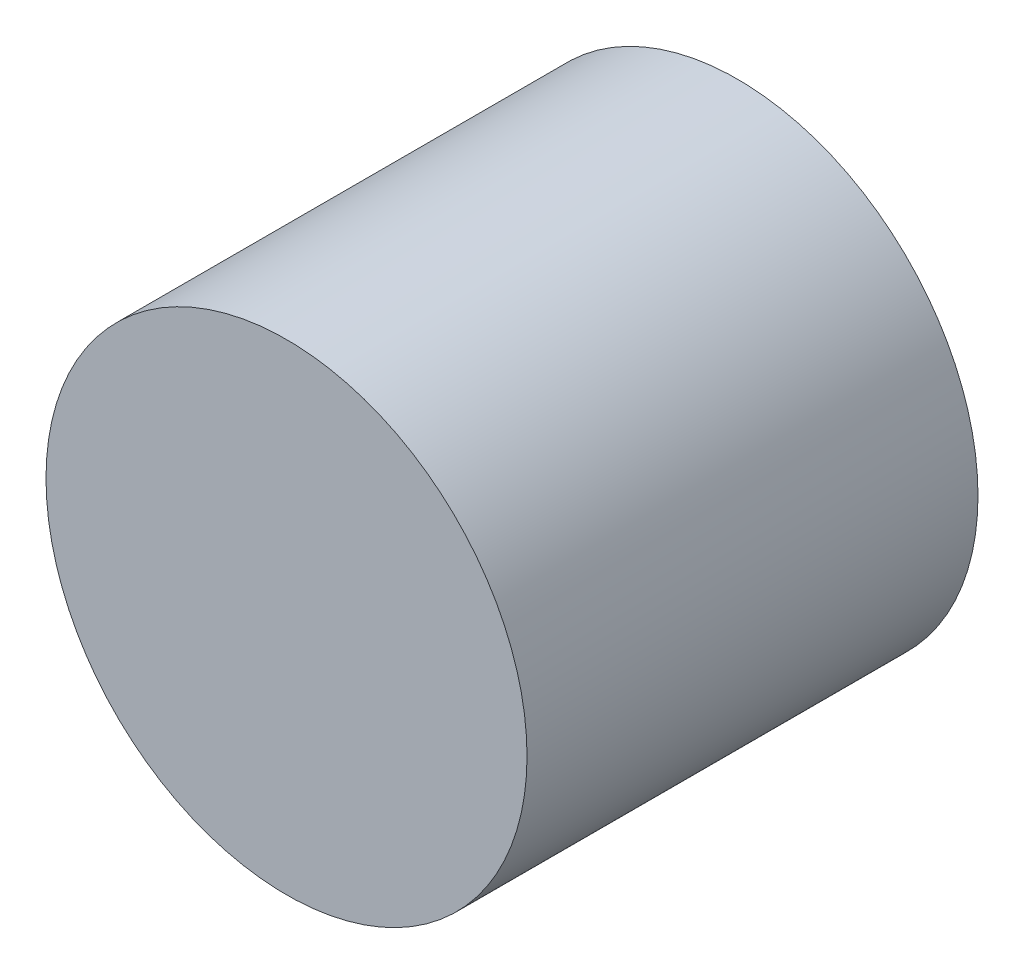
ISO-10303-21;
HEADER;
FILE_DESCRIPTION(('STEP AP214'),'2;1');
FILE_NAME('part.step','',(''),(''),'','','');
FILE_SCHEMA(('AUTOMOTIVE_DESIGN { 1 0 10303 214 1 1 1 1 }'));
ENDSEC;
DATA;
#1=APPLICATION_CONTEXT('core data for automotive mechanical design processes');
#2=APPLICATION_PROTOCOL_DEFINITION('international standard','automotive_design',2000,#1);
#3=PRODUCT_CONTEXT('',#1,'mechanical');
#4=PRODUCT('Part','Part','',(#3));
#5=PRODUCT_RELATED_PRODUCT_CATEGORY('part','',(#4));
#6=PRODUCT_DEFINITION_FORMATION('','',#4);
#7=PRODUCT_DEFINITION_CONTEXT('part definition',#1,'design');
#8=PRODUCT_DEFINITION('design','',#6,#7);
#9=PRODUCT_DEFINITION_SHAPE('','',#8);
#10=(LENGTH_UNIT() NAMED_UNIT(*) SI_UNIT(.MILLI.,.METRE.));
#11=(NAMED_UNIT(*) PLANE_ANGLE_UNIT() SI_UNIT($,.RADIAN.));
#12=(NAMED_UNIT(*) SI_UNIT($,.STERADIAN.) SOLID_ANGLE_UNIT());
#13=UNCERTAINTY_MEASURE_WITH_UNIT(LENGTH_MEASURE(1.E-05),#10,'distance_accuracy_value','');
#14=(GEOMETRIC_REPRESENTATION_CONTEXT(3) GLOBAL_UNCERTAINTY_ASSIGNED_CONTEXT((#13)) GLOBAL_UNIT_ASSIGNED_CONTEXT((#10,
#11,#12)) REPRESENTATION_CONTEXT('',''));
#15=CARTESIAN_POINT('',(0.,0.,0.));
#16=DIRECTION('',(0.,0.,1.));
#17=DIRECTION('',(1.,0.,0.));
#18=AXIS2_PLACEMENT_3D('',#15,#16,#17);
#19=CARTESIAN_POINT('',(0.,0.,0.));
#20=DIRECTION('',(0.,0.,1.));
#21=DIRECTION('',(1.,0.,0.));
#22=AXIS2_PLACEMENT_3D('',#19,#20,#21);
#23=PLANE('',#22);
#24=CARTESIAN_POINT('',(0.,0.,0.));
#25=DIRECTION('',(0.,0.,1.));
#26=DIRECTION('',(1.,0.,0.));
#27=AXIS2_PLACEMENT_3D('',#24,#25,#26);
#28=CIRCLE('',#27,8.);
#29=CARTESIAN_POINT('',(8.,0.,0.));
#30=VERTEX_POINT('',#29);
#31=EDGE_CURVE('E16',#30,#30,#28,.T.);
#32=ORIENTED_EDGE('',*,*,#31,.F.);
#33=EDGE_LOOP('',(#32));
#34=FACE_BOUND('',#33,.T.);
#35=ADVANCED_FACE('F12',(#34),#23,.F.);
#36=CARTESIAN_POINT('',(0.,0.,15.));
#37=DIRECTION('',(0.,0.,-1.));
#38=DIRECTION('',(-1.,0.,0.));
#39=AXIS2_PLACEMENT_3D('',#36,#37,#38);
#40=CYLINDRICAL_SURFACE('',#39,8.);
#41=CARTESIAN_POINT('',(0.,0.,15.));
#42=DIRECTION('',(0.,0.,1.));
#43=DIRECTION('',(1.,0.,0.));
#44=AXIS2_PLACEMENT_3D('',#41,#42,#43);
#45=CIRCLE('',#44,8.);
#46=CARTESIAN_POINT('',(8.,0.,15.));
#47=VERTEX_POINT('',#46);
#48=EDGE_CURVE('E8',#47,#47,#45,.T.);
#49=ORIENTED_EDGE('',*,*,#48,.F.);
#50=EDGE_LOOP('',(#49));
#51=FACE_BOUND('',#50,.T.);
#52=ORIENTED_EDGE('',*,*,#31,.T.);
#53=EDGE_LOOP('',(#52));
#54=FACE_BOUND('',#53,.T.);
#55=ADVANCED_FACE('F14',(#51,#54),#40,.T.);
#56=CARTESIAN_POINT('',(0.,0.,15.));
#57=DIRECTION('',(0.,0.,1.));
#58=DIRECTION('',(1.,0.,0.));
#59=AXIS2_PLACEMENT_3D('',#56,#57,#58);
#60=PLANE('',#59);
#61=ORIENTED_EDGE('',*,*,#48,.T.);
#62=EDGE_LOOP('',(#61));
#63=FACE_BOUND('',#62,.T.);
#64=ADVANCED_FACE('F32',(#63),#60,.T.);
#65=CLOSED_SHELL('',(#35,#55,#64));
#66=MANIFOLD_SOLID_BREP('B1',#65);
#67=ADVANCED_BREP_SHAPE_REPRESENTATION('',(#18,#66),#14);
#68=SHAPE_DEFINITION_REPRESENTATION(#9,#67);
ENDSEC;
END-ISO-10303-21;
